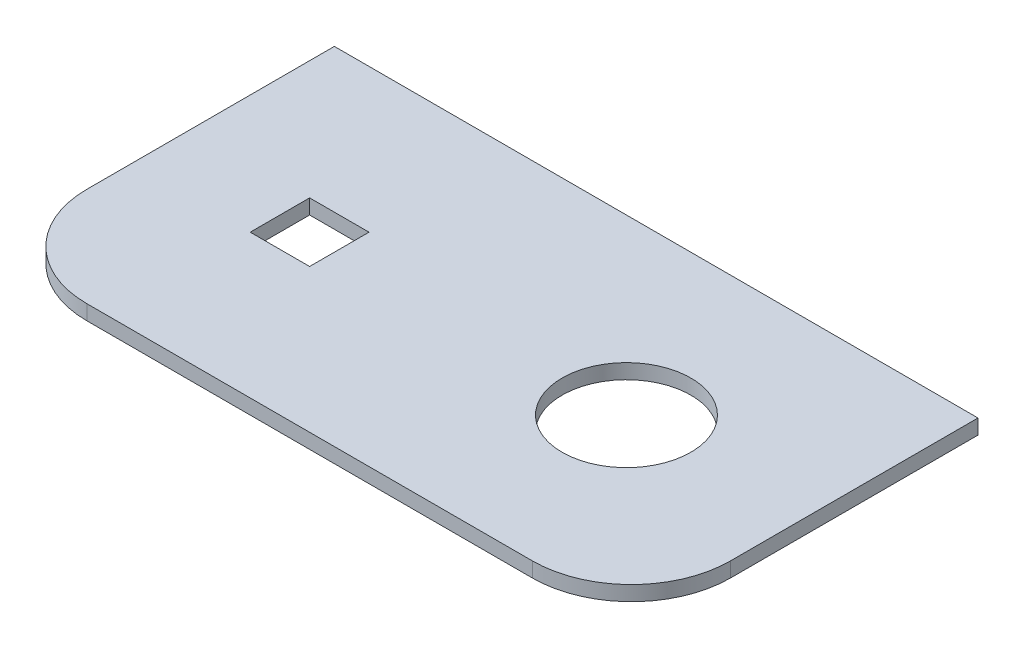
from build123d import *

# Parameters (mm, degrees)
SKETCH1_R           = 13
SKETCH1_W           = 12
SKETCH1_H           = 12
BOSS_EXTRUDE1_DEPTH = 3


with BuildPart() as part:
    # Sketch1 → Boss-Extrude1 (new body)
    with BuildSketch(Plane(origin=(0, 0, 0), x_dir=(1, 0, 0), z_dir=(0, 1, 0))):
        with BuildLine():
            Line((20, 0), (110, 0))
            ThreePointArc((110, 0), (124.142135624, 5.857864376), (130, 20))
            Line((130, 20), (130, 70))
            Line((130, 70), (0, 70))
            Line((0, 70), (0, 20))
            ThreePointArc((0, 20), (5.857864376, 5.857864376), (20, 0))
        make_face()
        with Locations(Location((94, 35, 0), (0, 0, 270))):
            Circle(SKETCH1_R, mode=Mode.SUBTRACT)
        with Locations((30, 35)):
            Rectangle(SKETCH1_W, SKETCH1_H, mode=Mode.SUBTRACT)
    extrude(amount=BOSS_EXTRUDE1_DEPTH)


solid = part.part
